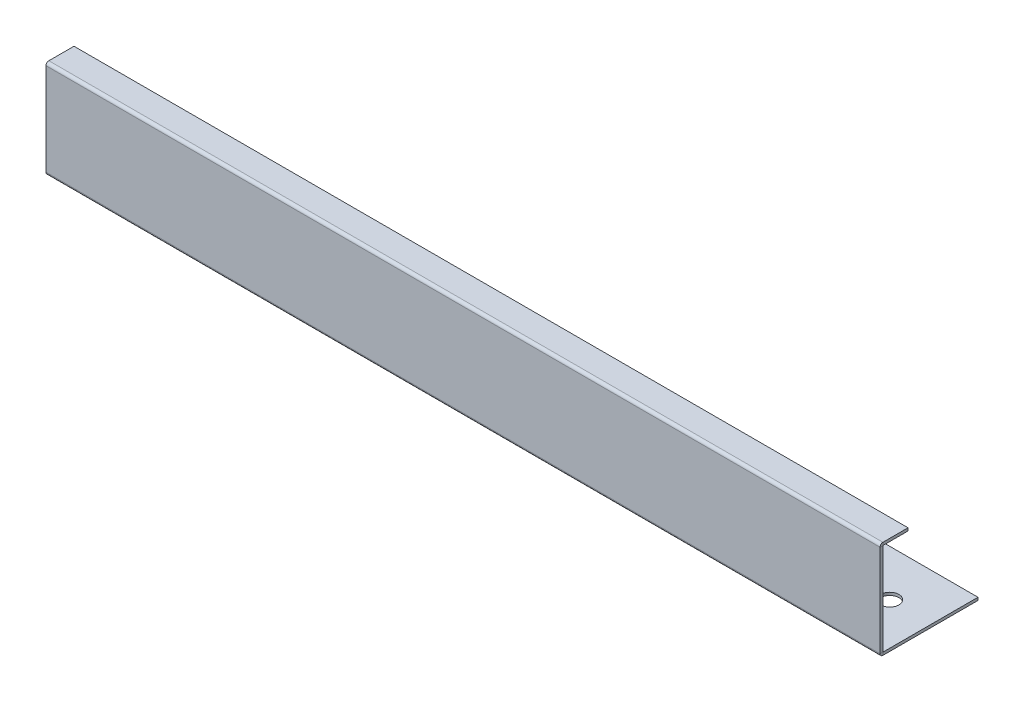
ISO-10303-21;
HEADER;
FILE_DESCRIPTION(('STEP AP214'),'2;1');
FILE_NAME('part.step','',(''),(''),'','','');
FILE_SCHEMA(('AUTOMOTIVE_DESIGN { 1 0 10303 214 1 1 1 1 }'));
ENDSEC;
DATA;
#1=APPLICATION_CONTEXT('core data for automotive mechanical design processes');
#2=APPLICATION_PROTOCOL_DEFINITION('international standard','automotive_design',2000,#1);
#3=PRODUCT_CONTEXT('',#1,'mechanical');
#4=PRODUCT('Part','Part','',(#3));
#5=PRODUCT_RELATED_PRODUCT_CATEGORY('part','',(#4));
#6=PRODUCT_DEFINITION_FORMATION('','',#4);
#7=PRODUCT_DEFINITION_CONTEXT('part definition',#1,'design');
#8=PRODUCT_DEFINITION('design','',#6,#7);
#9=PRODUCT_DEFINITION_SHAPE('','',#8);
#10=(LENGTH_UNIT() NAMED_UNIT(*) SI_UNIT(.MILLI.,.METRE.));
#11=(NAMED_UNIT(*) PLANE_ANGLE_UNIT() SI_UNIT($,.RADIAN.));
#12=(NAMED_UNIT(*) SI_UNIT($,.STERADIAN.) SOLID_ANGLE_UNIT());
#13=UNCERTAINTY_MEASURE_WITH_UNIT(LENGTH_MEASURE(1.E-05),#10,'distance_accuracy_value','');
#14=(GEOMETRIC_REPRESENTATION_CONTEXT(3) GLOBAL_UNCERTAINTY_ASSIGNED_CONTEXT((#13)) GLOBAL_UNIT_ASSIGNED_CONTEXT((#10,
#11,#12)) REPRESENTATION_CONTEXT('',''));
#15=CARTESIAN_POINT('',(0.,0.,0.));
#16=DIRECTION('',(0.,0.,1.));
#17=DIRECTION('',(1.,0.,0.));
#18=AXIS2_PLACEMENT_3D('',#15,#16,#17);
#19=CARTESIAN_POINT('',(298.,1.99999999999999,35.));
#20=DIRECTION('',(1.,0.,0.));
#21=DIRECTION('',(0.,0.,-1.));
#22=AXIS2_PLACEMENT_3D('',#19,#20,#21);
#23=PLANE('',#22);
#24=DIRECTION('',(0.,1.,0.));
#25=VECTOR('',#24,1.);
#26=CARTESIAN_POINT('',(298.,2.,33.));
#27=LINE('',#26,#25);
#28=CARTESIAN_POINT('',(298.,67.95,33.0000000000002));
#29=VERTEX_POINT('',#28);
#30=CARTESIAN_POINT('',(298.,2.05,33.));
#31=VERTEX_POINT('',#30);
#32=EDGE_CURVE('E234',#29,#31,#27,.F.);
#33=ORIENTED_EDGE('',*,*,#32,.F.);
#34=DIRECTION('',(0.,0.,1.));
#35=VECTOR('',#34,1.);
#36=CARTESIAN_POINT('',(298.,67.95,33.0000000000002));
#37=LINE('',#36,#35);
#38=CARTESIAN_POINT('',(298.,67.95,35.0000000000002));
#39=VERTEX_POINT('',#38);
#40=EDGE_CURVE('E217',#29,#39,#37,.T.);
#41=ORIENTED_EDGE('',*,*,#40,.T.);
#42=DIRECTION('',(0.,-1.,0.));
#43=VECTOR('',#42,1.);
#44=CARTESIAN_POINT('',(298.,1.99999999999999,35.));
#45=LINE('',#44,#43);
#46=CARTESIAN_POINT('',(298.,2.04999999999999,35.));
#47=VERTEX_POINT('',#46);
#48=EDGE_CURVE('E228',#39,#47,#45,.T.);
#49=ORIENTED_EDGE('',*,*,#48,.T.);
#50=DIRECTION('',(0.,0.,1.));
#51=VECTOR('',#50,1.);
#52=CARTESIAN_POINT('',(298.,2.04999999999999,33.));
#53=LINE('',#52,#51);
#54=EDGE_CURVE('E242',#31,#47,#53,.T.);
#55=ORIENTED_EDGE('',*,*,#54,.F.);
#56=EDGE_LOOP('',(#33,#41,#49,#55));
#57=FACE_BOUND('',#56,.T.);
#58=ADVANCED_FACE('F74',(#57),#23,.T.);
#59=CARTESIAN_POINT('',(298.,1.99999999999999,35.));
#60=DIRECTION('',(0.,0.,1.));
#61=DIRECTION('',(0.,-1.,0.));
#62=AXIS2_PLACEMENT_3D('',#59,#60,#61);
#63=PLANE('',#62);
#64=ORIENTED_EDGE('',*,*,#48,.F.);
#65=DIRECTION('',(1.,0.,0.));
#66=VECTOR('',#65,1.);
#67=CARTESIAN_POINT('',(298.,67.95,35.0000000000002));
#68=LINE('',#67,#66);
#69=CARTESIAN_POINT('',(-298.,67.95,35.0000000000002));
#70=VERTEX_POINT('',#69);
#71=EDGE_CURVE('E167',#39,#70,#68,.F.);
#72=ORIENTED_EDGE('',*,*,#71,.T.);
#73=DIRECTION('',(0.,1.,0.));
#74=VECTOR('',#73,1.);
#75=CARTESIAN_POINT('',(-298.,70.,35.0000000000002));
#76=LINE('',#75,#74);
#77=CARTESIAN_POINT('',(-298.,2.05,35.));
#78=VERTEX_POINT('',#77);
#79=EDGE_CURVE('E231',#78,#70,#76,.T.);
#80=ORIENTED_EDGE('',*,*,#79,.F.);
#81=DIRECTION('',(1.,0.,0.));
#82=VECTOR('',#81,1.);
#83=CARTESIAN_POINT('',(298.,2.04999999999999,35.));
#84=LINE('',#83,#82);
#85=EDGE_CURVE('E239',#78,#47,#84,.T.);
#86=ORIENTED_EDGE('',*,*,#85,.T.);
#87=EDGE_LOOP('',(#64,#72,#80,#86));
#88=FACE_BOUND('',#87,.T.);
#89=ADVANCED_FACE('F320',(#88),#63,.T.);
#90=CARTESIAN_POINT('',(298.,2.,33.));
#91=DIRECTION('',(0.,0.,1.));
#92=DIRECTION('',(0.,-1.,0.));
#93=AXIS2_PLACEMENT_3D('',#90,#91,#92);
#94=PLANE('',#93);
#95=DIRECTION('',(1.,0.,0.));
#96=VECTOR('',#95,1.);
#97=CARTESIAN_POINT('',(298.,67.95,33.0000000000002));
#98=LINE('',#97,#96);
#99=CARTESIAN_POINT('',(-298.,67.95,33.0000000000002));
#100=VERTEX_POINT('',#99);
#101=EDGE_CURVE('E221',#29,#100,#98,.F.);
#102=ORIENTED_EDGE('',*,*,#101,.F.);
#103=ORIENTED_EDGE('',*,*,#32,.T.);
#104=DIRECTION('',(-1.,0.,0.));
#105=VECTOR('',#104,1.);
#106=CARTESIAN_POINT('',(-298.,2.05,33.));
#107=LINE('',#106,#105);
#108=CARTESIAN_POINT('',(-298.,2.05,33.));
#109=VERTEX_POINT('',#108);
#110=EDGE_CURVE('E245',#109,#31,#107,.F.);
#111=ORIENTED_EDGE('',*,*,#110,.F.);
#112=DIRECTION('',(0.,-1.,0.));
#113=VECTOR('',#112,1.);
#114=CARTESIAN_POINT('',(-298.,2.,33.));
#115=LINE('',#114,#113);
#116=EDGE_CURVE('E236',#109,#100,#115,.F.);
#117=ORIENTED_EDGE('',*,*,#116,.T.);
#118=EDGE_LOOP('',(#102,#103,#111,#117));
#119=FACE_BOUND('',#118,.T.);
#120=ADVANCED_FACE('F326',(#119),#94,.F.);
#121=CARTESIAN_POINT('',(298.,2.,35.));
#122=DIRECTION('',(-1.,0.,0.));
#123=DIRECTION('',(0.,0.,1.));
#124=AXIS2_PLACEMENT_3D('',#121,#122,#123);
#125=PLANE('',#124);
#126=DIRECTION('',(0.,-1.,0.));
#127=VECTOR('',#126,1.);
#128=CARTESIAN_POINT('',(298.,1.99999999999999,32.95));
#129=LINE('',#128,#127);
#130=CARTESIAN_POINT('',(298.,1.99999999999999,32.95));
#131=VERTEX_POINT('',#130);
#132=CARTESIAN_POINT('',(298.,0.,32.95));
#133=VERTEX_POINT('',#132);
#134=EDGE_CURVE('E255',#131,#133,#129,.T.);
#135=ORIENTED_EDGE('',*,*,#134,.T.);
#136=DIRECTION('',(0.,0.,-1.));
#137=VECTOR('',#136,1.);
#138=CARTESIAN_POINT('',(298.,0.,35.));
#139=LINE('',#138,#137);
#140=CARTESIAN_POINT('',(298.,0.,-35.));
#141=VERTEX_POINT('',#140);
#142=EDGE_CURVE('E267',#133,#141,#139,.T.);
#143=ORIENTED_EDGE('',*,*,#142,.T.);
#144=DIRECTION('',(0.,-1.,0.));
#145=VECTOR('',#144,1.);
#146=CARTESIAN_POINT('',(298.,2.,-35.));
#147=LINE('',#146,#145);
#148=CARTESIAN_POINT('',(298.,2.,-35.));
#149=VERTEX_POINT('',#148);
#150=EDGE_CURVE('E13',#149,#141,#147,.T.);
#151=ORIENTED_EDGE('',*,*,#150,.F.);
#152=DIRECTION('',(0.,0.,-1.));
#153=VECTOR('',#152,1.);
#154=CARTESIAN_POINT('',(298.,2.,35.));
#155=LINE('',#154,#153);
#156=EDGE_CURVE('E270',#131,#149,#155,.T.);
#157=ORIENTED_EDGE('',*,*,#156,.F.);
#158=EDGE_LOOP('',(#135,#143,#151,#157));
#159=FACE_BOUND('',#158,.T.);
#160=ADVANCED_FACE('F76',(#159),#125,.F.);
#161=CARTESIAN_POINT('',(-298.,2.,35.));
#162=DIRECTION('',(1.,0.,0.));
#163=DIRECTION('',(0.,0.,-1.));
#164=AXIS2_PLACEMENT_3D('',#161,#162,#163);
#165=PLANE('',#164);
#166=DIRECTION('',(0.,-1.,0.));
#167=VECTOR('',#166,1.);
#168=CARTESIAN_POINT('',(-298.,1.99999999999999,32.95));
#169=LINE('',#168,#167);
#170=CARTESIAN_POINT('',(-298.,1.99999999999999,32.95));
#171=VERTEX_POINT('',#170);
#172=CARTESIAN_POINT('',(-298.,0.,32.95));
#173=VERTEX_POINT('',#172);
#174=EDGE_CURVE('E265',#171,#173,#169,.T.);
#175=ORIENTED_EDGE('',*,*,#174,.F.);
#176=DIRECTION('',(0.,0.,1.));
#177=VECTOR('',#176,1.);
#178=CARTESIAN_POINT('',(-298.,2.,35.));
#179=LINE('',#178,#177);
#180=CARTESIAN_POINT('',(-298.,2.,-35.));
#181=VERTEX_POINT('',#180);
#182=EDGE_CURVE('E275',#181,#171,#179,.T.);
#183=ORIENTED_EDGE('',*,*,#182,.F.);
#184=DIRECTION('',(0.,-1.,0.));
#185=VECTOR('',#184,1.);
#186=CARTESIAN_POINT('',(-298.,2.,-35.));
#187=LINE('',#186,#185);
#188=CARTESIAN_POINT('',(-298.,0.,-35.));
#189=VERTEX_POINT('',#188);
#190=EDGE_CURVE('E82',#181,#189,#187,.T.);
#191=ORIENTED_EDGE('',*,*,#190,.T.);
#192=DIRECTION('',(0.,0.,1.));
#193=VECTOR('',#192,1.);
#194=CARTESIAN_POINT('',(-298.,0.,35.));
#195=LINE('',#194,#193);
#196=EDGE_CURVE('E273',#189,#173,#195,.T.);
#197=ORIENTED_EDGE('',*,*,#196,.T.);
#198=EDGE_LOOP('',(#175,#183,#191,#197));
#199=FACE_BOUND('',#198,.T.);
#200=ADVANCED_FACE('F288',(#199),#165,.F.);
#201=CARTESIAN_POINT('',(298.,2.,-35.));
#202=DIRECTION('',(0.,-1.,0.));
#203=DIRECTION('',(0.,0.,-1.));
#204=AXIS2_PLACEMENT_3D('',#201,#202,#203);
#205=PLANE('',#204);
#206=CARTESIAN_POINT('',(268.,2.,-1.99999999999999));
#207=DIRECTION('',(0.,-1.,0.));
#208=DIRECTION('',(0.,0.,1.));
#209=AXIS2_PLACEMENT_3D('',#206,#207,#208);
#210=CIRCLE('',#209,6.50000000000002);
#211=CARTESIAN_POINT('',(268.,2.,4.50000000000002));
#212=VERTEX_POINT('',#211);
#213=EDGE_CURVE('E382',#212,#212,#210,.T.);
#214=ORIENTED_EDGE('',*,*,#213,.T.);
#215=EDGE_LOOP('',(#214));
#216=FACE_BOUND('',#215,.T.);
#217=CARTESIAN_POINT('',(-268.,2.,-1.99999999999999));
#218=DIRECTION('',(0.,-1.,0.));
#219=DIRECTION('',(0.,0.,-1.));
#220=AXIS2_PLACEMENT_3D('',#217,#218,#219);
#221=CIRCLE('',#220,6.50000000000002);
#222=CARTESIAN_POINT('',(-268.,2.,-8.50000000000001));
#223=VERTEX_POINT('',#222);
#224=EDGE_CURVE('E215',#223,#223,#221,.T.);
#225=ORIENTED_EDGE('',*,*,#224,.T.);
#226=EDGE_LOOP('',(#225));
#227=FACE_BOUND('',#226,.T.);
#228=DIRECTION('',(1.,0.,0.));
#229=VECTOR('',#228,1.);
#230=CARTESIAN_POINT('',(298.,1.99999999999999,32.95));
#231=LINE('',#230,#229);
#232=EDGE_CURVE('E261',#131,#171,#231,.F.);
#233=ORIENTED_EDGE('',*,*,#232,.F.);
#234=ORIENTED_EDGE('',*,*,#156,.T.);
#235=DIRECTION('',(-1.,0.,0.));
#236=VECTOR('',#235,1.);
#237=CARTESIAN_POINT('',(-298.,2.,-35.));
#238=LINE('',#237,#236);
#239=EDGE_CURVE('E272',#149,#181,#238,.T.);
#240=ORIENTED_EDGE('',*,*,#239,.T.);
#241=ORIENTED_EDGE('',*,*,#182,.T.);
#242=EDGE_LOOP('',(#233,#234,#240,#241));
#243=FACE_BOUND('',#242,.T.);
#244=ADVANCED_FACE('F306',(#216,#227,#243),#205,.F.);
#245=CARTESIAN_POINT('',(298.,0.,-35.));
#246=DIRECTION('',(0.,-1.,0.));
#247=DIRECTION('',(0.,0.,-1.));
#248=AXIS2_PLACEMENT_3D('',#245,#246,#247);
#249=PLANE('',#248);
#250=CARTESIAN_POINT('',(268.,0.,-1.99999999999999));
#251=DIRECTION('',(0.,-1.,0.));
#252=DIRECTION('',(0.,0.,1.));
#253=AXIS2_PLACEMENT_3D('',#250,#251,#252);
#254=CIRCLE('',#253,6.50000000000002);
#255=CARTESIAN_POINT('',(268.,0.,4.50000000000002));
#256=VERTEX_POINT('',#255);
#257=EDGE_CURVE('E385',#256,#256,#254,.T.);
#258=ORIENTED_EDGE('',*,*,#257,.F.);
#259=EDGE_LOOP('',(#258));
#260=FACE_BOUND('',#259,.T.);
#261=CARTESIAN_POINT('',(-268.,0.,-1.99999999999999));
#262=DIRECTION('',(0.,-1.,0.));
#263=DIRECTION('',(0.,0.,-1.));
#264=AXIS2_PLACEMENT_3D('',#261,#262,#263);
#265=CIRCLE('',#264,6.50000000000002);
#266=CARTESIAN_POINT('',(-268.,0.,-8.50000000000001));
#267=VERTEX_POINT('',#266);
#268=EDGE_CURVE('E379',#267,#267,#265,.T.);
#269=ORIENTED_EDGE('',*,*,#268,.F.);
#270=EDGE_LOOP('',(#269));
#271=FACE_BOUND('',#270,.T.);
#272=ORIENTED_EDGE('',*,*,#142,.F.);
#273=DIRECTION('',(1.,0.,0.));
#274=VECTOR('',#273,1.);
#275=CARTESIAN_POINT('',(298.,0.,32.95));
#276=LINE('',#275,#274);
#277=EDGE_CURVE('E250',#133,#173,#276,.F.);
#278=ORIENTED_EDGE('',*,*,#277,.T.);
#279=ORIENTED_EDGE('',*,*,#196,.F.);
#280=DIRECTION('',(-1.,0.,0.));
#281=VECTOR('',#280,1.);
#282=CARTESIAN_POINT('',(-298.,0.,-35.));
#283=LINE('',#282,#281);
#284=EDGE_CURVE('E279',#141,#189,#283,.T.);
#285=ORIENTED_EDGE('',*,*,#284,.F.);
#286=EDGE_LOOP('',(#272,#278,#279,#285));
#287=FACE_BOUND('',#286,.T.);
#288=ADVANCED_FACE('F294',(#260,#271,#287),#249,.T.);
#289=CARTESIAN_POINT('',(-298.,2.,-35.));
#290=DIRECTION('',(0.,0.,1.));
#291=DIRECTION('',(1.,0.,0.));
#292=AXIS2_PLACEMENT_3D('',#289,#290,#291);
#293=PLANE('',#292);
#294=ORIENTED_EDGE('',*,*,#284,.T.);
#295=ORIENTED_EDGE('',*,*,#190,.F.);
#296=ORIENTED_EDGE('',*,*,#239,.F.);
#297=ORIENTED_EDGE('',*,*,#150,.T.);
#298=EDGE_LOOP('',(#294,#295,#296,#297));
#299=FACE_BOUND('',#298,.T.);
#300=ADVANCED_FACE('F307',(#299),#293,.F.);
#301=CARTESIAN_POINT('',(-298.,2.05,32.95));
#302=DIRECTION('',(-1.,0.,0.));
#303=DIRECTION('',(0.,0.,1.));
#304=AXIS2_PLACEMENT_3D('',#301,#302,#303);
#305=PLANE('',#304);
#306=DIRECTION('',(0.,0.,1.));
#307=VECTOR('',#306,1.);
#308=CARTESIAN_POINT('',(-298.,2.05,35.0000000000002));
#309=LINE('',#308,#307);
#310=EDGE_CURVE('E226',#109,#78,#309,.T.);
#311=ORIENTED_EDGE('',*,*,#310,.F.);
#312=CARTESIAN_POINT('',(-298.,2.05,32.95));
#313=DIRECTION('',(1.,0.,0.));
#314=DIRECTION('',(0.,0.,-1.));
#315=AXIS2_PLACEMENT_3D('',#312,#313,#314);
#316=CIRCLE('',#315,0.0500000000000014);
#317=EDGE_CURVE('E258',#171,#109,#316,.F.);
#318=ORIENTED_EDGE('',*,*,#317,.F.);
#319=ORIENTED_EDGE('',*,*,#174,.T.);
#320=CARTESIAN_POINT('',(-298.,2.05,32.95));
#321=DIRECTION('',(1.,0.,0.));
#322=DIRECTION('',(0.,0.,-1.));
#323=AXIS2_PLACEMENT_3D('',#320,#321,#322);
#324=CIRCLE('',#323,2.05);
#325=EDGE_CURVE('E97',#173,#78,#324,.F.);
#326=ORIENTED_EDGE('',*,*,#325,.T.);
#327=EDGE_LOOP('',(#311,#318,#319,#326));
#328=FACE_BOUND('',#327,.T.);
#329=ADVANCED_FACE('F309',(#328),#305,.T.);
#330=CARTESIAN_POINT('',(298.,2.05,32.95));
#331=DIRECTION('',(-1.,0.,0.));
#332=DIRECTION('',(0.,0.,1.));
#333=AXIS2_PLACEMENT_3D('',#330,#331,#332);
#334=PLANE('',#333);
#335=CARTESIAN_POINT('',(298.,2.05,32.95));
#336=DIRECTION('',(1.,0.,0.));
#337=DIRECTION('',(0.,0.,-1.));
#338=AXIS2_PLACEMENT_3D('',#335,#336,#337);
#339=CIRCLE('',#338,0.0500000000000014);
#340=EDGE_CURVE('E230',#31,#131,#339,.T.);
#341=ORIENTED_EDGE('',*,*,#340,.F.);
#342=ORIENTED_EDGE('',*,*,#54,.T.);
#343=CARTESIAN_POINT('',(298.,2.05,32.95));
#344=DIRECTION('',(1.,0.,0.));
#345=DIRECTION('',(0.,0.,-1.));
#346=AXIS2_PLACEMENT_3D('',#343,#344,#345);
#347=CIRCLE('',#346,2.05);
#348=EDGE_CURVE('E253',#47,#133,#347,.T.);
#349=ORIENTED_EDGE('',*,*,#348,.T.);
#350=ORIENTED_EDGE('',*,*,#134,.F.);
#351=EDGE_LOOP('',(#341,#342,#349,#350));
#352=FACE_BOUND('',#351,.T.);
#353=ADVANCED_FACE('F299',(#352),#334,.F.);
#354=CARTESIAN_POINT('',(298.,2.05,32.95));
#355=DIRECTION('',(1.,0.,0.));
#356=DIRECTION('',(0.,0.,1.));
#357=AXIS2_PLACEMENT_3D('',#354,#355,#356);
#358=CYLINDRICAL_SURFACE('',#357,2.05);
#359=ORIENTED_EDGE('',*,*,#277,.F.);
#360=ORIENTED_EDGE('',*,*,#348,.F.);
#361=ORIENTED_EDGE('',*,*,#85,.F.);
#362=ORIENTED_EDGE('',*,*,#325,.F.);
#363=EDGE_LOOP('',(#359,#360,#361,#362));
#364=FACE_BOUND('',#363,.T.);
#365=ADVANCED_FACE('F296',(#364),#358,.T.);
#366=CARTESIAN_POINT('',(298.,2.05,32.95));
#367=DIRECTION('',(1.,0.,0.));
#368=DIRECTION('',(0.,0.,1.));
#369=AXIS2_PLACEMENT_3D('',#366,#367,#368);
#370=CYLINDRICAL_SURFACE('',#369,0.0500000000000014);
#371=ORIENTED_EDGE('',*,*,#232,.T.);
#372=ORIENTED_EDGE('',*,*,#317,.T.);
#373=ORIENTED_EDGE('',*,*,#110,.T.);
#374=ORIENTED_EDGE('',*,*,#340,.T.);
#375=EDGE_LOOP('',(#371,#372,#373,#374));
#376=FACE_BOUND('',#375,.T.);
#377=ADVANCED_FACE('F336',(#376),#370,.F.);
#378=CARTESIAN_POINT('',(-298.,70.,35.0000000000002));
#379=DIRECTION('',(-1.,0.,0.));
#380=DIRECTION('',(0.,0.,1.));
#381=AXIS2_PLACEMENT_3D('',#378,#379,#380);
#382=PLANE('',#381);
#383=DIRECTION('',(0.,0.,1.));
#384=VECTOR('',#383,1.);
#385=CARTESIAN_POINT('',(-298.,67.95,33.0000000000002));
#386=LINE('',#385,#384);
#387=EDGE_CURVE('E224',#100,#70,#386,.T.);
#388=ORIENTED_EDGE('',*,*,#387,.F.);
#389=ORIENTED_EDGE('',*,*,#116,.F.);
#390=ORIENTED_EDGE('',*,*,#310,.T.);
#391=ORIENTED_EDGE('',*,*,#79,.T.);
#392=EDGE_LOOP('',(#388,#389,#390,#391));
#393=FACE_BOUND('',#392,.T.);
#394=ADVANCED_FACE('F332',(#393),#382,.T.);
#395=CARTESIAN_POINT('',(-298.,67.95,32.9500000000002));
#396=DIRECTION('',(-1.,0.,0.));
#397=DIRECTION('',(0.,0.,1.));
#398=AXIS2_PLACEMENT_3D('',#395,#396,#397);
#399=PLANE('',#398);
#400=DIRECTION('',(0.,1.,0.));
#401=VECTOR('',#400,1.);
#402=CARTESIAN_POINT('',(-298.,70.,32.9500000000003));
#403=LINE('',#402,#401);
#404=CARTESIAN_POINT('',(-298.,68.,32.9500000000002));
#405=VERTEX_POINT('',#404);
#406=CARTESIAN_POINT('',(-298.,70.,32.9500000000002));
#407=VERTEX_POINT('',#406);
#408=EDGE_CURVE('E212',#405,#407,#403,.T.);
#409=ORIENTED_EDGE('',*,*,#408,.F.);
#410=CARTESIAN_POINT('',(-298.,67.95,32.9500000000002));
#411=DIRECTION('',(1.,0.,0.));
#412=DIRECTION('',(0.,0.,-1.));
#413=AXIS2_PLACEMENT_3D('',#410,#411,#412);
#414=CIRCLE('',#413,0.0499999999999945);
#415=EDGE_CURVE('E170',#100,#405,#414,.F.);
#416=ORIENTED_EDGE('',*,*,#415,.F.);
#417=ORIENTED_EDGE('',*,*,#387,.T.);
#418=CARTESIAN_POINT('',(-298.,67.95,32.9500000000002));
#419=DIRECTION('',(1.,0.,0.));
#420=DIRECTION('',(0.,0.,-1.));
#421=AXIS2_PLACEMENT_3D('',#418,#419,#420);
#422=CIRCLE('',#421,2.04999999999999);
#423=EDGE_CURVE('E89',#70,#407,#422,.F.);
#424=ORIENTED_EDGE('',*,*,#423,.T.);
#425=EDGE_LOOP('',(#409,#416,#417,#424));
#426=FACE_BOUND('',#425,.T.);
#427=ADVANCED_FACE('F335',(#426),#399,.T.);
#428=CARTESIAN_POINT('',(298.,67.95,32.9500000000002));
#429=DIRECTION('',(-1.,0.,0.));
#430=DIRECTION('',(0.,0.,1.));
#431=AXIS2_PLACEMENT_3D('',#428,#429,#430);
#432=PLANE('',#431);
#433=CARTESIAN_POINT('',(298.,67.95,32.9500000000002));
#434=DIRECTION('',(1.,0.,0.));
#435=DIRECTION('',(0.,0.,-1.));
#436=AXIS2_PLACEMENT_3D('',#433,#434,#435);
#437=CIRCLE('',#436,0.0499999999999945);
#438=CARTESIAN_POINT('',(298.,68.,32.9500000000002));
#439=VERTEX_POINT('',#438);
#440=EDGE_CURVE('E177',#439,#29,#437,.T.);
#441=ORIENTED_EDGE('',*,*,#440,.F.);
#442=DIRECTION('',(0.,1.,0.));
#443=VECTOR('',#442,1.);
#444=CARTESIAN_POINT('',(298.,68.,32.9500000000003));
#445=LINE('',#444,#443);
#446=CARTESIAN_POINT('',(298.,70.,32.9500000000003));
#447=VERTEX_POINT('',#446);
#448=EDGE_CURVE('E174',#439,#447,#445,.T.);
#449=ORIENTED_EDGE('',*,*,#448,.T.);
#450=CARTESIAN_POINT('',(298.,67.95,32.9500000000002));
#451=DIRECTION('',(1.,0.,0.));
#452=DIRECTION('',(0.,0.,-1.));
#453=AXIS2_PLACEMENT_3D('',#450,#451,#452);
#454=CIRCLE('',#453,2.04999999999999);
#455=EDGE_CURVE('E161',#447,#39,#454,.T.);
#456=ORIENTED_EDGE('',*,*,#455,.T.);
#457=ORIENTED_EDGE('',*,*,#40,.F.);
#458=EDGE_LOOP('',(#441,#449,#456,#457));
#459=FACE_BOUND('',#458,.T.);
#460=ADVANCED_FACE('F175',(#459),#432,.F.);
#461=CARTESIAN_POINT('',(298.,67.95,32.9500000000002));
#462=DIRECTION('',(1.,0.,0.));
#463=DIRECTION('',(0.,1.,0.));
#464=AXIS2_PLACEMENT_3D('',#461,#462,#463);
#465=CYLINDRICAL_SURFACE('',#464,2.04999999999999);
#466=ORIENTED_EDGE('',*,*,#71,.F.);
#467=ORIENTED_EDGE('',*,*,#455,.F.);
#468=DIRECTION('',(1.,0.,0.));
#469=VECTOR('',#468,1.);
#470=CARTESIAN_POINT('',(298.,70.,32.9500000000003));
#471=LINE('',#470,#469);
#472=EDGE_CURVE('E165',#407,#447,#471,.T.);
#473=ORIENTED_EDGE('',*,*,#472,.F.);
#474=ORIENTED_EDGE('',*,*,#423,.F.);
#475=EDGE_LOOP('',(#466,#467,#473,#474));
#476=FACE_BOUND('',#475,.T.);
#477=ADVANCED_FACE('F163',(#476),#465,.T.);
#478=CARTESIAN_POINT('',(298.,67.95,32.9500000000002));
#479=DIRECTION('',(1.,0.,0.));
#480=DIRECTION('',(0.,1.,0.));
#481=AXIS2_PLACEMENT_3D('',#478,#479,#480);
#482=CYLINDRICAL_SURFACE('',#481,0.0499999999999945);
#483=ORIENTED_EDGE('',*,*,#101,.T.);
#484=ORIENTED_EDGE('',*,*,#415,.T.);
#485=DIRECTION('',(-1.,0.,0.));
#486=VECTOR('',#485,1.);
#487=CARTESIAN_POINT('',(-298.,68.,32.9500000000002));
#488=LINE('',#487,#486);
#489=EDGE_CURVE('E182',#405,#439,#488,.F.);
#490=ORIENTED_EDGE('',*,*,#489,.T.);
#491=ORIENTED_EDGE('',*,*,#440,.T.);
#492=EDGE_LOOP('',(#483,#484,#490,#491));
#493=FACE_BOUND('',#492,.T.);
#494=ADVANCED_FACE('F368',(#493),#482,.F.);
#495=CARTESIAN_POINT('',(298.,70.,33.0000000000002));
#496=DIRECTION('',(1.,0.,0.));
#497=DIRECTION('',(0.,0.,-1.));
#498=AXIS2_PLACEMENT_3D('',#495,#496,#497);
#499=PLANE('',#498);
#500=DIRECTION('',(0.,0.,1.));
#501=VECTOR('',#500,1.);
#502=CARTESIAN_POINT('',(298.,70.,33.0000000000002));
#503=LINE('',#502,#501);
#504=CARTESIAN_POINT('',(298.,70.0000000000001,15.0000000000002));
#505=VERTEX_POINT('',#504);
#506=EDGE_CURVE('E189',#505,#447,#503,.T.);
#507=ORIENTED_EDGE('',*,*,#506,.T.);
#508=ORIENTED_EDGE('',*,*,#448,.F.);
#509=DIRECTION('',(0.,0.,-1.));
#510=VECTOR('',#509,1.);
#511=CARTESIAN_POINT('',(298.,68.,33.0000000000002));
#512=LINE('',#511,#510);
#513=CARTESIAN_POINT('',(298.,68.0000000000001,15.0000000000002));
#514=VERTEX_POINT('',#513);
#515=EDGE_CURVE('E205',#514,#439,#512,.F.);
#516=ORIENTED_EDGE('',*,*,#515,.F.);
#517=DIRECTION('',(0.,-1.,0.));
#518=VECTOR('',#517,1.);
#519=CARTESIAN_POINT('',(298.,70.0000000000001,15.0000000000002));
#520=LINE('',#519,#518);
#521=EDGE_CURVE('E194',#505,#514,#520,.T.);
#522=ORIENTED_EDGE('',*,*,#521,.F.);
#523=EDGE_LOOP('',(#507,#508,#516,#522));
#524=FACE_BOUND('',#523,.T.);
#525=ADVANCED_FACE('F193',(#524),#499,.T.);
#526=CARTESIAN_POINT('',(-298.,70.0000000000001,15.0000000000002));
#527=DIRECTION('',(-1.,0.,0.));
#528=DIRECTION('',(0.,0.,1.));
#529=AXIS2_PLACEMENT_3D('',#526,#527,#528);
#530=PLANE('',#529);
#531=DIRECTION('',(0.,0.,1.));
#532=VECTOR('',#531,1.);
#533=CARTESIAN_POINT('',(-298.,68.,33.0000000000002));
#534=LINE('',#533,#532);
#535=CARTESIAN_POINT('',(-298.,68.0000000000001,15.0000000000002));
#536=VERTEX_POINT('',#535);
#537=EDGE_CURVE('E191',#405,#536,#534,.F.);
#538=ORIENTED_EDGE('',*,*,#537,.F.);
#539=ORIENTED_EDGE('',*,*,#408,.T.);
#540=DIRECTION('',(0.,0.,-1.));
#541=VECTOR('',#540,1.);
#542=CARTESIAN_POINT('',(-298.,70.0000000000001,15.0000000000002));
#543=LINE('',#542,#541);
#544=CARTESIAN_POINT('',(-298.,70.0000000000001,15.0000000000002));
#545=VERTEX_POINT('',#544);
#546=EDGE_CURVE('E190',#407,#545,#543,.T.);
#547=ORIENTED_EDGE('',*,*,#546,.T.);
#548=DIRECTION('',(0.,-1.,0.));
#549=VECTOR('',#548,1.);
#550=CARTESIAN_POINT('',(-298.,70.0000000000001,15.0000000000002));
#551=LINE('',#550,#549);
#552=EDGE_CURVE('E196',#545,#536,#551,.T.);
#553=ORIENTED_EDGE('',*,*,#552,.T.);
#554=EDGE_LOOP('',(#538,#539,#547,#553));
#555=FACE_BOUND('',#554,.T.);
#556=ADVANCED_FACE('F373',(#555),#530,.T.);
#557=CARTESIAN_POINT('',(298.,70.,33.0000000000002));
#558=DIRECTION('',(0.,1.,0.));
#559=DIRECTION('',(0.,0.,1.));
#560=AXIS2_PLACEMENT_3D('',#557,#558,#559);
#561=PLANE('',#560);
#562=ORIENTED_EDGE('',*,*,#546,.F.);
#563=ORIENTED_EDGE('',*,*,#472,.T.);
#564=ORIENTED_EDGE('',*,*,#506,.F.);
#565=DIRECTION('',(1.,0.,0.));
#566=VECTOR('',#565,1.);
#567=CARTESIAN_POINT('',(298.,70.0000000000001,15.0000000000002));
#568=LINE('',#567,#566);
#569=EDGE_CURVE('E197',#545,#505,#568,.T.);
#570=ORIENTED_EDGE('',*,*,#569,.F.);
#571=EDGE_LOOP('',(#562,#563,#564,#570));
#572=FACE_BOUND('',#571,.T.);
#573=ADVANCED_FACE('F187',(#572),#561,.T.);
#574=CARTESIAN_POINT('',(298.,68.,33.0000000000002));
#575=DIRECTION('',(0.,1.,0.));
#576=DIRECTION('',(0.,0.,1.));
#577=AXIS2_PLACEMENT_3D('',#574,#575,#576);
#578=PLANE('',#577);
#579=ORIENTED_EDGE('',*,*,#489,.F.);
#580=ORIENTED_EDGE('',*,*,#537,.T.);
#581=DIRECTION('',(-1.,0.,0.));
#582=VECTOR('',#581,1.);
#583=CARTESIAN_POINT('',(298.,68.0000000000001,15.0000000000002));
#584=LINE('',#583,#582);
#585=EDGE_CURVE('E207',#536,#514,#584,.F.);
#586=ORIENTED_EDGE('',*,*,#585,.T.);
#587=ORIENTED_EDGE('',*,*,#515,.T.);
#588=EDGE_LOOP('',(#579,#580,#586,#587));
#589=FACE_BOUND('',#588,.T.);
#590=ADVANCED_FACE('F371',(#589),#578,.F.);
#591=CARTESIAN_POINT('',(298.,70.0000000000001,15.0000000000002));
#592=DIRECTION('',(0.,0.,-1.));
#593=DIRECTION('',(0.,1.,0.));
#594=AXIS2_PLACEMENT_3D('',#591,#592,#593);
#595=PLANE('',#594);
#596=ORIENTED_EDGE('',*,*,#585,.F.);
#597=ORIENTED_EDGE('',*,*,#552,.F.);
#598=ORIENTED_EDGE('',*,*,#569,.T.);
#599=ORIENTED_EDGE('',*,*,#521,.T.);
#600=EDGE_LOOP('',(#596,#597,#598,#599));
#601=FACE_BOUND('',#600,.T.);
#602=ADVANCED_FACE('F377',(#601),#595,.T.);
#603=CARTESIAN_POINT('',(-268.,2.,-1.99999999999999));
#604=DIRECTION('',(0.,-1.,0.));
#605=DIRECTION('',(0.,0.,-1.));
#606=AXIS2_PLACEMENT_3D('',#603,#604,#605);
#607=CYLINDRICAL_SURFACE('',#606,6.50000000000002);
#608=ORIENTED_EDGE('',*,*,#224,.F.);
#609=EDGE_LOOP('',(#608));
#610=FACE_BOUND('',#609,.T.);
#611=ORIENTED_EDGE('',*,*,#268,.T.);
#612=EDGE_LOOP('',(#611));
#613=FACE_BOUND('',#612,.T.);
#614=ADVANCED_FACE('F395',(#610,#613),#607,.F.);
#615=CARTESIAN_POINT('',(268.,2.,-1.99999999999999));
#616=DIRECTION('',(0.,-1.,0.));
#617=DIRECTION('',(0.,0.,-1.));
#618=AXIS2_PLACEMENT_3D('',#615,#616,#617);
#619=CYLINDRICAL_SURFACE('',#618,6.50000000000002);
#620=ORIENTED_EDGE('',*,*,#213,.F.);
#621=EDGE_LOOP('',(#620));
#622=FACE_BOUND('',#621,.T.);
#623=ORIENTED_EDGE('',*,*,#257,.T.);
#624=EDGE_LOOP('',(#623));
#625=FACE_BOUND('',#624,.T.);
#626=ADVANCED_FACE('F392',(#622,#625),#619,.F.);
#627=CLOSED_SHELL('',(#58,#89,#120,#160,#200,#244,#288,#300,#329,#353,#365,#377,#394,#427,#460,
#477,#494,#525,#556,#573,#590,#602,#614,#626));
#628=MANIFOLD_SOLID_BREP('B2',#627);
#629=ADVANCED_BREP_SHAPE_REPRESENTATION('',(#18,#628),#14);
#630=SHAPE_DEFINITION_REPRESENTATION(#9,#629);
ENDSEC;
END-ISO-10303-21;
